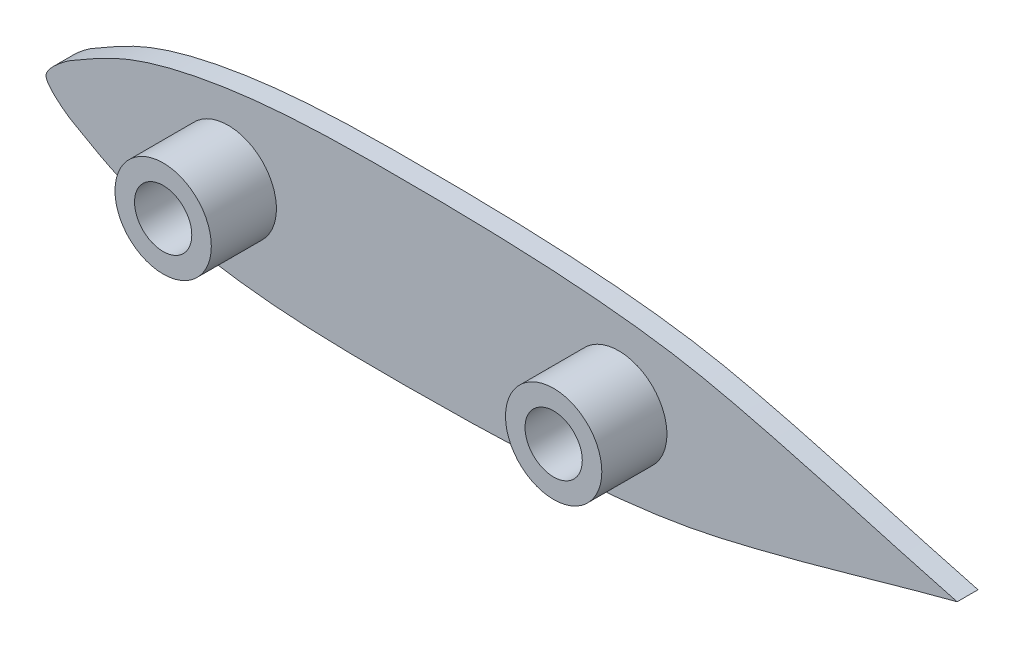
ISO-10303-21;
HEADER;
FILE_DESCRIPTION(('STEP AP214'),'2;1');
FILE_NAME('part.step','',(''),(''),'','','');
FILE_SCHEMA(('AUTOMOTIVE_DESIGN { 1 0 10303 214 1 1 1 1 }'));
ENDSEC;
DATA;
#1=APPLICATION_CONTEXT('core data for automotive mechanical design processes');
#2=APPLICATION_PROTOCOL_DEFINITION('international standard','automotive_design',2000,#1);
#3=PRODUCT_CONTEXT('',#1,'mechanical');
#4=PRODUCT('Part','Part','',(#3));
#5=PRODUCT_RELATED_PRODUCT_CATEGORY('part','',(#4));
#6=PRODUCT_DEFINITION_FORMATION('','',#4);
#7=PRODUCT_DEFINITION_CONTEXT('part definition',#1,'design');
#8=PRODUCT_DEFINITION('design','',#6,#7);
#9=PRODUCT_DEFINITION_SHAPE('','',#8);
#10=(LENGTH_UNIT() NAMED_UNIT(*) SI_UNIT(.MILLI.,.METRE.));
#11=(NAMED_UNIT(*) PLANE_ANGLE_UNIT() SI_UNIT($,.RADIAN.));
#12=(NAMED_UNIT(*) SI_UNIT($,.STERADIAN.) SOLID_ANGLE_UNIT());
#13=UNCERTAINTY_MEASURE_WITH_UNIT(LENGTH_MEASURE(1.E-05),#10,'distance_accuracy_value','');
#14=(GEOMETRIC_REPRESENTATION_CONTEXT(3) GLOBAL_UNCERTAINTY_ASSIGNED_CONTEXT((#13)) GLOBAL_UNIT_ASSIGNED_CONTEXT((#10,
#11,#12)) REPRESENTATION_CONTEXT('',''));
#15=CARTESIAN_POINT('',(0.,0.,0.));
#16=DIRECTION('',(0.,0.,1.));
#17=DIRECTION('',(1.,0.,0.));
#18=AXIS2_PLACEMENT_3D('',#15,#16,#17);
#19=CARTESIAN_POINT('',(0.,0.,0.8));
#20=CARTESIAN_POINT('',(0.00772713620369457,-0.267032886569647,0.8));
#21=CARTESIAN_POINT('',(0.79724552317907,-0.898720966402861,0.8));
#22=CARTESIAN_POINT('',(1.40995747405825,-1.2361498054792,0.8));
#23=CARTESIAN_POINT('',(3.06998534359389,-2.25920057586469,0.8));
#24=CARTESIAN_POINT('',(7.56542515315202,-3.331084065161,0.8));
#25=CARTESIAN_POINT('',(13.3623850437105,-3.48289192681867,0.8));
#26=CARTESIAN_POINT('',(22.2900394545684,-3.26527474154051,0.8));
#27=CARTESIAN_POINT('',(29.2938291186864,-1.65212955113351,0.8));
#28=CARTESIAN_POINT('',(32.2346092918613,-0.717869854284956,0.8));
#29=CARTESIAN_POINT('',(35.,0.,0.8));
#30=B_SPLINE_CURVE_WITH_KNOTS('',3,(#19,#20,#21,#22,#23,#24,#25,#26,#27,#28,#29),.UNSPECIFIED.,
.F.,.F.,(4,1,1,1,1,1,1,1,4),(0.,0.0225244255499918,0.0346430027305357,0.121185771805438,
0.243771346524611,0.472972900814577,0.711145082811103,0.763847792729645,1.),.UNSPECIFIED.);
#31=DIRECTION('',(0.,0.,-1.));
#32=VECTOR('',#31,1.);
#33=SURFACE_OF_LINEAR_EXTRUSION('',#30,#32);
#34=CARTESIAN_POINT('',(0.,0.,0.));
#35=CARTESIAN_POINT('',(0.00772713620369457,-0.267032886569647,0.));
#36=CARTESIAN_POINT('',(0.79724552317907,-0.898720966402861,0.));
#37=CARTESIAN_POINT('',(1.40995747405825,-1.2361498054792,0.));
#38=CARTESIAN_POINT('',(3.06998534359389,-2.25920057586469,0.));
#39=CARTESIAN_POINT('',(7.56542515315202,-3.331084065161,0.));
#40=CARTESIAN_POINT('',(13.3623850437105,-3.48289192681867,0.));
#41=CARTESIAN_POINT('',(22.2900394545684,-3.26527474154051,0.));
#42=CARTESIAN_POINT('',(29.2938291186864,-1.65212955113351,0.));
#43=CARTESIAN_POINT('',(32.2346092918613,-0.717869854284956,0.));
#44=CARTESIAN_POINT('',(35.,0.,0.));
#45=B_SPLINE_CURVE_WITH_KNOTS('',3,(#34,#35,#36,#37,#38,#39,#40,#41,#42,#43,#44),.UNSPECIFIED.,
.F.,.F.,(4,1,1,1,1,1,1,1,4),(0.,0.0225244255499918,0.0346430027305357,0.121185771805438,
0.243771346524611,0.472972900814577,0.711145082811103,0.763847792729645,1.),.UNSPECIFIED.);
#46=CARTESIAN_POINT('',(0.,0.,0.));
#47=VERTEX_POINT('',#46);
#48=CARTESIAN_POINT('',(35.,0.,0.));
#49=VERTEX_POINT('',#48);
#50=EDGE_CURVE('E78',#47,#49,#45,.T.);
#51=ORIENTED_EDGE('',*,*,#50,.T.);
#52=DIRECTION('',(0.,0.,-1.));
#53=VECTOR('',#52,1.);
#54=CARTESIAN_POINT('',(35.,0.,0.8));
#55=LINE('',#54,#53);
#56=CARTESIAN_POINT('',(35.,0.,0.8));
#57=VERTEX_POINT('',#56);
#58=EDGE_CURVE('E74',#57,#49,#55,.T.);
#59=ORIENTED_EDGE('',*,*,#58,.F.);
#60=CARTESIAN_POINT('',(0.,0.,0.8));
#61=VERTEX_POINT('',#60);
#62=EDGE_CURVE('E77',#61,#57,#30,.T.);
#63=ORIENTED_EDGE('',*,*,#62,.F.);
#64=DIRECTION('',(0.,0.,-1.));
#65=VECTOR('',#64,1.);
#66=CARTESIAN_POINT('',(0.,0.,0.8));
#67=LINE('',#66,#65);
#68=EDGE_CURVE('E71',#61,#47,#67,.T.);
#69=ORIENTED_EDGE('',*,*,#68,.T.);
#70=EDGE_LOOP('',(#51,#59,#63,#69));
#71=FACE_BOUND('',#70,.T.);
#72=ADVANCED_FACE('F39',(#71),#33,.F.);
#73=CARTESIAN_POINT('',(35.,0.,0.8));
#74=CARTESIAN_POINT('',(32.2346092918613,0.717869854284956,0.8));
#75=CARTESIAN_POINT('',(29.2938291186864,1.65212955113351,0.8));
#76=CARTESIAN_POINT('',(22.2900394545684,3.26527474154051,0.8));
#77=CARTESIAN_POINT('',(13.3623850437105,3.48289192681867,0.8));
#78=CARTESIAN_POINT('',(7.56542515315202,3.331084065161,0.8));
#79=CARTESIAN_POINT('',(3.06998534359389,2.25920057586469,0.8));
#80=CARTESIAN_POINT('',(1.40995747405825,1.2361498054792,0.8));
#81=CARTESIAN_POINT('',(0.79724552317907,0.898720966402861,0.8));
#82=CARTESIAN_POINT('',(0.00772713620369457,0.267032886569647,0.8));
#83=CARTESIAN_POINT('',(0.,0.,0.8));
#84=B_SPLINE_CURVE_WITH_KNOTS('',3,(#73,#74,#75,#76,#77,#78,#79,#80,#81,#82,#83),.UNSPECIFIED.,
.F.,.F.,(4,1,1,1,1,1,1,1,4),(0.,0.236152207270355,0.288854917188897,0.527027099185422,
0.756228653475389,0.878814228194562,0.965356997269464,0.977475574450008,1.),.UNSPECIFIED.);
#85=DIRECTION('',(0.,0.,-1.));
#86=VECTOR('',#85,1.);
#87=SURFACE_OF_LINEAR_EXTRUSION('',#84,#86);
#88=CARTESIAN_POINT('',(35.,0.,0.));
#89=CARTESIAN_POINT('',(32.2346092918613,0.717869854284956,0.));
#90=CARTESIAN_POINT('',(29.2938291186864,1.65212955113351,0.));
#91=CARTESIAN_POINT('',(22.2900394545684,3.26527474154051,0.));
#92=CARTESIAN_POINT('',(13.3623850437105,3.48289192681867,0.));
#93=CARTESIAN_POINT('',(7.56542515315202,3.331084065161,0.));
#94=CARTESIAN_POINT('',(3.06998534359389,2.25920057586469,0.));
#95=CARTESIAN_POINT('',(1.40995747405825,1.2361498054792,0.));
#96=CARTESIAN_POINT('',(0.79724552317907,0.898720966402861,0.));
#97=CARTESIAN_POINT('',(0.00772713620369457,0.267032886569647,0.));
#98=CARTESIAN_POINT('',(0.,0.,0.));
#99=B_SPLINE_CURVE_WITH_KNOTS('',3,(#88,#89,#90,#91,#92,#93,#94,#95,#96,#97,#98),.UNSPECIFIED.,
.F.,.F.,(4,1,1,1,1,1,1,1,4),(0.,0.236152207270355,0.288854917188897,0.527027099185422,
0.756228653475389,0.878814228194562,0.965356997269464,0.977475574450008,1.),.UNSPECIFIED.);
#100=EDGE_CURVE('E66',#49,#47,#99,.T.);
#101=ORIENTED_EDGE('',*,*,#100,.T.);
#102=ORIENTED_EDGE('',*,*,#68,.F.);
#103=EDGE_CURVE('E58',#57,#61,#84,.T.);
#104=ORIENTED_EDGE('',*,*,#103,.F.);
#105=ORIENTED_EDGE('',*,*,#58,.T.);
#106=EDGE_LOOP('',(#101,#102,#104,#105));
#107=FACE_BOUND('',#106,.T.);
#108=ADVANCED_FACE('F70',(#107),#87,.F.);
#109=CARTESIAN_POINT('',(15.2198385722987,-3.39482084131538,0.8));
#110=DIRECTION('',(0.,0.,-1.));
#111=DIRECTION('',(-1.,0.,0.));
#112=AXIS2_PLACEMENT_3D('',#109,#110,#111);
#113=PLANE('',#112);
#114=CARTESIAN_POINT('',(22.,0.,0.8));
#115=DIRECTION('',(0.,0.,-1.));
#116=DIRECTION('',(-1.,0.,0.));
#117=AXIS2_PLACEMENT_3D('',#114,#115,#116);
#118=CIRCLE('',#117,1.85);
#119=CARTESIAN_POINT('',(20.15,0.,0.8));
#120=VERTEX_POINT('',#119);
#121=EDGE_CURVE('E11',#120,#120,#118,.F.);
#122=ORIENTED_EDGE('',*,*,#121,.F.);
#123=EDGE_LOOP('',(#122));
#124=FACE_BOUND('',#123,.T.);
#125=CARTESIAN_POINT('',(7.,0.,0.8));
#126=DIRECTION('',(0.,0.,-1.));
#127=DIRECTION('',(-1.,0.,0.));
#128=AXIS2_PLACEMENT_3D('',#125,#126,#127);
#129=CIRCLE('',#128,1.85);
#130=CARTESIAN_POINT('',(5.15,0.,0.8));
#131=VERTEX_POINT('',#130);
#132=EDGE_CURVE('E50',#131,#131,#129,.F.);
#133=ORIENTED_EDGE('',*,*,#132,.F.);
#134=EDGE_LOOP('',(#133));
#135=FACE_BOUND('',#134,.T.);
#136=ORIENTED_EDGE('',*,*,#62,.T.);
#137=ORIENTED_EDGE('',*,*,#103,.T.);
#138=EDGE_LOOP('',(#136,#137));
#139=FACE_BOUND('',#138,.T.);
#140=ADVANCED_FACE('F140',(#124,#135,#139),#113,.F.);
#141=CARTESIAN_POINT('',(15.2198385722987,-3.39482084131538,0.));
#142=DIRECTION('',(0.,0.,-1.));
#143=DIRECTION('',(-1.,0.,0.));
#144=AXIS2_PLACEMENT_3D('',#141,#142,#143);
#145=PLANE('',#144);
#146=CARTESIAN_POINT('',(7.,0.,0.));
#147=DIRECTION('',(0.,0.,-1.));
#148=DIRECTION('',(-1.,0.,0.));
#149=AXIS2_PLACEMENT_3D('',#146,#147,#148);
#150=CIRCLE('',#149,1.1);
#151=CARTESIAN_POINT('',(5.9,0.,0.));
#152=VERTEX_POINT('',#151);
#153=EDGE_CURVE('E85',#152,#152,#150,.T.);
#154=ORIENTED_EDGE('',*,*,#153,.F.);
#155=EDGE_LOOP('',(#154));
#156=FACE_BOUND('',#155,.T.);
#157=CARTESIAN_POINT('',(22.,0.,0.));
#158=DIRECTION('',(0.,0.,-1.));
#159=DIRECTION('',(-1.,0.,0.));
#160=AXIS2_PLACEMENT_3D('',#157,#158,#159);
#161=CIRCLE('',#160,1.1);
#162=CARTESIAN_POINT('',(20.9,0.,0.));
#163=VERTEX_POINT('',#162);
#164=EDGE_CURVE('E89',#163,#163,#161,.T.);
#165=ORIENTED_EDGE('',*,*,#164,.F.);
#166=EDGE_LOOP('',(#165));
#167=FACE_BOUND('',#166,.T.);
#168=ORIENTED_EDGE('',*,*,#50,.F.);
#169=ORIENTED_EDGE('',*,*,#100,.F.);
#170=EDGE_LOOP('',(#168,#169));
#171=FACE_BOUND('',#170,.T.);
#172=ADVANCED_FACE('F83',(#156,#167,#171),#145,.T.);
#173=CARTESIAN_POINT('',(22.,0.,-8.));
#174=DIRECTION('',(0.,0.,1.));
#175=DIRECTION('',(1.,0.,0.));
#176=AXIS2_PLACEMENT_3D('',#173,#174,#175);
#177=CYLINDRICAL_SURFACE('',#176,1.1);
#178=ORIENTED_EDGE('',*,*,#164,.T.);
#179=EDGE_LOOP('',(#178));
#180=FACE_BOUND('',#179,.T.);
#181=CARTESIAN_POINT('',(22.,0.,3.3));
#182=DIRECTION('',(0.,0.,1.));
#183=DIRECTION('',(1.,0.,0.));
#184=AXIS2_PLACEMENT_3D('',#181,#182,#183);
#185=CIRCLE('',#184,1.1);
#186=CARTESIAN_POINT('',(23.1,0.,3.3));
#187=VERTEX_POINT('',#186);
#188=EDGE_CURVE('E114',#187,#187,#185,.T.);
#189=ORIENTED_EDGE('',*,*,#188,.T.);
#190=EDGE_LOOP('',(#189));
#191=FACE_BOUND('',#190,.T.);
#192=ADVANCED_FACE('F148',(#180,#191),#177,.F.);
#193=CARTESIAN_POINT('',(7.,0.,-8.));
#194=DIRECTION('',(0.,0.,1.));
#195=DIRECTION('',(1.,0.,0.));
#196=AXIS2_PLACEMENT_3D('',#193,#194,#195);
#197=CYLINDRICAL_SURFACE('',#196,1.1);
#198=ORIENTED_EDGE('',*,*,#153,.T.);
#199=EDGE_LOOP('',(#198));
#200=FACE_BOUND('',#199,.T.);
#201=CARTESIAN_POINT('',(7.,0.,3.3));
#202=DIRECTION('',(0.,0.,1.));
#203=DIRECTION('',(1.,0.,0.));
#204=AXIS2_PLACEMENT_3D('',#201,#202,#203);
#205=CIRCLE('',#204,1.1);
#206=CARTESIAN_POINT('',(8.1,0.,3.3));
#207=VERTEX_POINT('',#206);
#208=EDGE_CURVE('E43',#207,#207,#205,.T.);
#209=ORIENTED_EDGE('',*,*,#208,.T.);
#210=EDGE_LOOP('',(#209));
#211=FACE_BOUND('',#210,.T.);
#212=ADVANCED_FACE('F184',(#200,#211),#197,.F.);
#213=CARTESIAN_POINT('',(7.,0.,3.3));
#214=DIRECTION('',(0.,0.,-1.));
#215=DIRECTION('',(-1.,0.,0.));
#216=AXIS2_PLACEMENT_3D('',#213,#214,#215);
#217=CYLINDRICAL_SURFACE('',#216,1.85);
#218=CARTESIAN_POINT('',(7.,0.,3.3));
#219=DIRECTION('',(0.,0.,1.));
#220=DIRECTION('',(1.,0.,0.));
#221=AXIS2_PLACEMENT_3D('',#218,#219,#220);
#222=CIRCLE('',#221,1.85);
#223=CARTESIAN_POINT('',(8.85,0.,3.3));
#224=VERTEX_POINT('',#223);
#225=EDGE_CURVE('E110',#224,#224,#222,.T.);
#226=ORIENTED_EDGE('',*,*,#225,.F.);
#227=EDGE_LOOP('',(#226));
#228=FACE_BOUND('',#227,.T.);
#229=ORIENTED_EDGE('',*,*,#132,.T.);
#230=EDGE_LOOP('',(#229));
#231=FACE_BOUND('',#230,.T.);
#232=ADVANCED_FACE('F178',(#228,#231),#217,.T.);
#233=CARTESIAN_POINT('',(7.,0.,3.3));
#234=DIRECTION('',(0.,0.,1.));
#235=DIRECTION('',(1.,0.,0.));
#236=AXIS2_PLACEMENT_3D('',#233,#234,#235);
#237=PLANE('',#236);
#238=ORIENTED_EDGE('',*,*,#208,.F.);
#239=EDGE_LOOP('',(#238));
#240=FACE_BOUND('',#239,.T.);
#241=ORIENTED_EDGE('',*,*,#225,.T.);
#242=EDGE_LOOP('',(#241));
#243=FACE_BOUND('',#242,.T.);
#244=ADVANCED_FACE('F183',(#240,#243),#237,.T.);
#245=CARTESIAN_POINT('',(22.,0.,3.3));
#246=DIRECTION('',(0.,0.,-1.));
#247=DIRECTION('',(-1.,0.,0.));
#248=AXIS2_PLACEMENT_3D('',#245,#246,#247);
#249=CYLINDRICAL_SURFACE('',#248,1.85);
#250=CARTESIAN_POINT('',(22.,0.,3.3));
#251=DIRECTION('',(0.,0.,1.));
#252=DIRECTION('',(1.,0.,0.));
#253=AXIS2_PLACEMENT_3D('',#250,#251,#252);
#254=CIRCLE('',#253,1.85);
#255=CARTESIAN_POINT('',(23.85,0.,3.3));
#256=VERTEX_POINT('',#255);
#257=EDGE_CURVE('E121',#256,#256,#254,.T.);
#258=ORIENTED_EDGE('',*,*,#257,.F.);
#259=EDGE_LOOP('',(#258));
#260=FACE_BOUND('',#259,.T.);
#261=ORIENTED_EDGE('',*,*,#121,.T.);
#262=EDGE_LOOP('',(#261));
#263=FACE_BOUND('',#262,.T.);
#264=ADVANCED_FACE('F194',(#260,#263),#249,.T.);
#265=CARTESIAN_POINT('',(22.,0.,3.3));
#266=DIRECTION('',(0.,0.,1.));
#267=DIRECTION('',(1.,0.,0.));
#268=AXIS2_PLACEMENT_3D('',#265,#266,#267);
#269=PLANE('',#268);
#270=ORIENTED_EDGE('',*,*,#188,.F.);
#271=EDGE_LOOP('',(#270));
#272=FACE_BOUND('',#271,.T.);
#273=ORIENTED_EDGE('',*,*,#257,.T.);
#274=EDGE_LOOP('',(#273));
#275=FACE_BOUND('',#274,.T.);
#276=ADVANCED_FACE('F199',(#272,#275),#269,.T.);
#277=CLOSED_SHELL('',(#72,#108,#140,#172,#192,#212,#232,#244,#264,#276));
#278=MANIFOLD_SOLID_BREP('B2',#277);
#279=ADVANCED_BREP_SHAPE_REPRESENTATION('',(#18,#278),#14);
#280=SHAPE_DEFINITION_REPRESENTATION(#9,#279);
ENDSEC;
END-ISO-10303-21;
